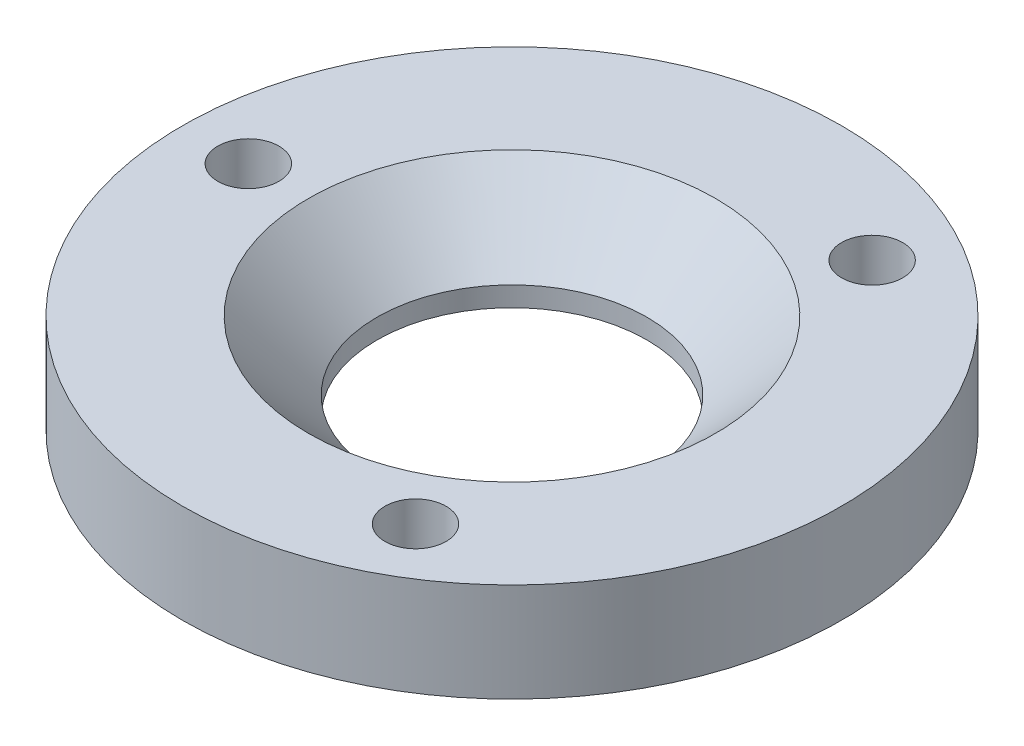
ISO-10303-21;
HEADER;
FILE_DESCRIPTION(('STEP AP214'),'2;1');
FILE_NAME('part.step','',(''),(''),'','','');
FILE_SCHEMA(('AUTOMOTIVE_DESIGN { 1 0 10303 214 1 1 1 1 }'));
ENDSEC;
DATA;
#1=APPLICATION_CONTEXT('core data for automotive mechanical design processes');
#2=APPLICATION_PROTOCOL_DEFINITION('international standard','automotive_design',2000,#1);
#3=PRODUCT_CONTEXT('',#1,'mechanical');
#4=PRODUCT('Part','Part','',(#3));
#5=PRODUCT_RELATED_PRODUCT_CATEGORY('part','',(#4));
#6=PRODUCT_DEFINITION_FORMATION('','',#4);
#7=PRODUCT_DEFINITION_CONTEXT('part definition',#1,'design');
#8=PRODUCT_DEFINITION('design','',#6,#7);
#9=PRODUCT_DEFINITION_SHAPE('','',#8);
#10=(LENGTH_UNIT() NAMED_UNIT(*) SI_UNIT(.MILLI.,.METRE.));
#11=(NAMED_UNIT(*) PLANE_ANGLE_UNIT() SI_UNIT($,.RADIAN.));
#12=(NAMED_UNIT(*) SI_UNIT($,.STERADIAN.) SOLID_ANGLE_UNIT());
#13=UNCERTAINTY_MEASURE_WITH_UNIT(LENGTH_MEASURE(1.E-05),#10,'distance_accuracy_value','');
#14=(GEOMETRIC_REPRESENTATION_CONTEXT(3) GLOBAL_UNCERTAINTY_ASSIGNED_CONTEXT((#13)) GLOBAL_UNIT_ASSIGNED_CONTEXT((#10,
#11,#12)) REPRESENTATION_CONTEXT('',''));
#15=CARTESIAN_POINT('',(0.,0.,0.));
#16=DIRECTION('',(0.,0.,1.));
#17=DIRECTION('',(1.,0.,0.));
#18=AXIS2_PLACEMENT_3D('',#15,#16,#17);
#19=CARTESIAN_POINT('',(0.,0.,0.));
#20=DIRECTION('',(0.,1.,0.));
#21=DIRECTION('',(0.,0.,1.));
#22=AXIS2_PLACEMENT_3D('',#19,#20,#21);
#23=CYLINDRICAL_SURFACE('',#22,10.16);
#24=CARTESIAN_POINT('',(0.,-4.7625,0.));
#25=DIRECTION('',(0.,1.,0.));
#26=DIRECTION('',(0.,0.,1.));
#27=AXIS2_PLACEMENT_3D('',#24,#25,#26);
#28=CIRCLE('',#27,10.16);
#29=CARTESIAN_POINT('',(0.,-4.7625,10.16));
#30=VERTEX_POINT('',#29);
#31=EDGE_CURVE('E42',#30,#30,#28,.T.);
#32=ORIENTED_EDGE('',*,*,#31,.F.);
#33=EDGE_LOOP('',(#32));
#34=FACE_BOUND('',#33,.T.);
#35=CARTESIAN_POINT('',(0.,-4.25450000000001,0.));
#36=DIRECTION('',(0.,1.,0.));
#37=DIRECTION('',(0.,0.,1.));
#38=AXIS2_PLACEMENT_3D('',#35,#36,#37);
#39=CIRCLE('',#38,10.16);
#40=CARTESIAN_POINT('',(0.,-4.25450000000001,10.16));
#41=VERTEX_POINT('',#40);
#42=EDGE_CURVE('E57',#41,#41,#39,.T.);
#43=ORIENTED_EDGE('',*,*,#42,.T.);
#44=EDGE_LOOP('',(#43));
#45=FACE_BOUND('',#44,.T.);
#46=ADVANCED_FACE('F32',(#34,#45),#23,.F.);
#47=CARTESIAN_POINT('',(0.,-4.7625,-15.875));
#48=DIRECTION('',(0.,1.,0.));
#49=DIRECTION('',(0.,0.,1.));
#50=AXIS2_PLACEMENT_3D('',#47,#48,#49);
#51=PLANE('',#50);
#52=CARTESIAN_POINT('',(6.3499999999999,-4.7625,-10.9985226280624));
#53=DIRECTION('',(0.,1.,0.));
#54=DIRECTION('',(0.,0.,1.));
#55=AXIS2_PLACEMENT_3D('',#52,#53,#54);
#56=CIRCLE('',#55,1.4732);
#57=CARTESIAN_POINT('',(6.3499999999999,-4.7625,-9.52532262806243));
#58=VERTEX_POINT('',#57);
#59=EDGE_CURVE('E75',#58,#58,#56,.T.);
#60=ORIENTED_EDGE('',*,*,#59,.T.);
#61=EDGE_LOOP('',(#60));
#62=FACE_BOUND('',#61,.T.);
#63=CARTESIAN_POINT('',(6.35000000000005,-4.7625,10.9985226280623));
#64=DIRECTION('',(0.,1.,0.));
#65=DIRECTION('',(0.,0.,1.));
#66=AXIS2_PLACEMENT_3D('',#63,#64,#65);
#67=CIRCLE('',#66,1.4732);
#68=CARTESIAN_POINT('',(6.35000000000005,-4.7625,12.4717226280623));
#69=VERTEX_POINT('',#68);
#70=EDGE_CURVE('E69',#69,#69,#67,.T.);
#71=ORIENTED_EDGE('',*,*,#70,.T.);
#72=EDGE_LOOP('',(#71));
#73=FACE_BOUND('',#72,.T.);
#74=CARTESIAN_POINT('',(-12.7,-4.7625,0.));
#75=DIRECTION('',(0.,1.,0.));
#76=DIRECTION('',(0.,0.,1.));
#77=AXIS2_PLACEMENT_3D('',#74,#75,#76);
#78=CIRCLE('',#77,1.4732);
#79=CARTESIAN_POINT('',(-12.7,-4.7625,1.4732));
#80=VERTEX_POINT('',#79);
#81=EDGE_CURVE('E63',#80,#80,#78,.T.);
#82=ORIENTED_EDGE('',*,*,#81,.T.);
#83=EDGE_LOOP('',(#82));
#84=FACE_BOUND('',#83,.T.);
#85=CARTESIAN_POINT('',(0.,-4.7625,0.));
#86=DIRECTION('',(0.,1.,0.));
#87=DIRECTION('',(0.,0.,1.));
#88=AXIS2_PLACEMENT_3D('',#85,#86,#87);
#89=CIRCLE('',#88,15.875);
#90=CARTESIAN_POINT('',(0.,-4.7625,15.875));
#91=VERTEX_POINT('',#90);
#92=EDGE_CURVE('E46',#91,#91,#89,.T.);
#93=ORIENTED_EDGE('',*,*,#92,.F.);
#94=EDGE_LOOP('',(#93));
#95=FACE_BOUND('',#94,.T.);
#96=ORIENTED_EDGE('',*,*,#31,.T.);
#97=EDGE_LOOP('',(#96));
#98=FACE_BOUND('',#97,.T.);
#99=ADVANCED_FACE('F79',(#62,#73,#84,#95,#98),#51,.F.);
#100=CARTESIAN_POINT('',(0.,0.,0.));
#101=DIRECTION('',(0.,1.,0.));
#102=DIRECTION('',(0.,0.,1.));
#103=AXIS2_PLACEMENT_3D('',#100,#101,#102);
#104=CYLINDRICAL_SURFACE('',#103,15.875);
#105=CARTESIAN_POINT('',(0.,0.,0.));
#106=DIRECTION('',(0.,1.,0.));
#107=DIRECTION('',(0.,0.,1.));
#108=AXIS2_PLACEMENT_3D('',#105,#106,#107);
#109=CIRCLE('',#108,15.875);
#110=CARTESIAN_POINT('',(0.,0.,15.875));
#111=VERTEX_POINT('',#110);
#112=EDGE_CURVE('E51',#111,#111,#109,.T.);
#113=ORIENTED_EDGE('',*,*,#112,.F.);
#114=EDGE_LOOP('',(#113));
#115=FACE_BOUND('',#114,.T.);
#116=ORIENTED_EDGE('',*,*,#92,.T.);
#117=EDGE_LOOP('',(#116));
#118=FACE_BOUND('',#117,.T.);
#119=ADVANCED_FACE('F94',(#115,#118),#104,.T.);
#120=CARTESIAN_POINT('',(0.,0.,-6.5024));
#121=DIRECTION('',(0.,-1.,0.));
#122=DIRECTION('',(0.,0.,-1.));
#123=AXIS2_PLACEMENT_3D('',#120,#121,#122);
#124=PLANE('',#123);
#125=CARTESIAN_POINT('',(0.,0.,0.));
#126=DIRECTION('',(0.,-1.,0.));
#127=DIRECTION('',(0.,0.,-1.));
#128=AXIS2_PLACEMENT_3D('',#125,#126,#127);
#129=CIRCLE('',#128,9.80440000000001);
#130=CARTESIAN_POINT('',(0.,0.,-9.80440000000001));
#131=VERTEX_POINT('',#130);
#132=EDGE_CURVE('E10',#131,#131,#129,.T.);
#133=ORIENTED_EDGE('',*,*,#132,.T.);
#134=EDGE_LOOP('',(#133));
#135=FACE_BOUND('',#134,.T.);
#136=CARTESIAN_POINT('',(6.3499999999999,0.,-10.9985226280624));
#137=DIRECTION('',(0.,1.,0.));
#138=DIRECTION('',(0.,0.,1.));
#139=AXIS2_PLACEMENT_3D('',#136,#137,#138);
#140=CIRCLE('',#139,1.4732);
#141=CARTESIAN_POINT('',(6.3499999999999,0.,-9.52532262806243));
#142=VERTEX_POINT('',#141);
#143=EDGE_CURVE('E72',#142,#142,#140,.T.);
#144=ORIENTED_EDGE('',*,*,#143,.F.);
#145=EDGE_LOOP('',(#144));
#146=FACE_BOUND('',#145,.T.);
#147=CARTESIAN_POINT('',(6.35000000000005,0.,10.9985226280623));
#148=DIRECTION('',(0.,1.,0.));
#149=DIRECTION('',(0.,0.,1.));
#150=AXIS2_PLACEMENT_3D('',#147,#148,#149);
#151=CIRCLE('',#150,1.4732);
#152=CARTESIAN_POINT('',(6.35000000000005,0.,12.4717226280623));
#153=VERTEX_POINT('',#152);
#154=EDGE_CURVE('E66',#153,#153,#151,.T.);
#155=ORIENTED_EDGE('',*,*,#154,.F.);
#156=EDGE_LOOP('',(#155));
#157=FACE_BOUND('',#156,.T.);
#158=CARTESIAN_POINT('',(-12.7,0.,0.));
#159=DIRECTION('',(0.,1.,0.));
#160=DIRECTION('',(0.,0.,1.));
#161=AXIS2_PLACEMENT_3D('',#158,#159,#160);
#162=CIRCLE('',#161,1.4732);
#163=CARTESIAN_POINT('',(-12.7,0.,1.4732));
#164=VERTEX_POINT('',#163);
#165=EDGE_CURVE('E60',#164,#164,#162,.T.);
#166=ORIENTED_EDGE('',*,*,#165,.F.);
#167=EDGE_LOOP('',(#166));
#168=FACE_BOUND('',#167,.T.);
#169=ORIENTED_EDGE('',*,*,#112,.T.);
#170=EDGE_LOOP('',(#169));
#171=FACE_BOUND('',#170,.T.);
#172=ADVANCED_FACE('F90',(#135,#146,#157,#168,#171),#124,.F.);
#173=CARTESIAN_POINT('',(0.,0.,0.));
#174=DIRECTION('',(0.,1.,0.));
#175=DIRECTION('',(0.,0.,1.));
#176=AXIS2_PLACEMENT_3D('',#173,#174,#175);
#177=CYLINDRICAL_SURFACE('',#176,6.5024);
#178=CARTESIAN_POINT('',(0.,-3.302,0.));
#179=DIRECTION('',(0.,-1.,0.));
#180=DIRECTION('',(0.,0.,-1.));
#181=AXIS2_PLACEMENT_3D('',#178,#179,#180);
#182=CIRCLE('',#181,6.5024);
#183=CARTESIAN_POINT('',(0.,-3.302,-6.5024));
#184=VERTEX_POINT('',#183);
#185=EDGE_CURVE('E38',#184,#184,#182,.F.);
#186=ORIENTED_EDGE('',*,*,#185,.T.);
#187=EDGE_LOOP('',(#186));
#188=FACE_BOUND('',#187,.T.);
#189=CARTESIAN_POINT('',(0.,-4.25450000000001,0.));
#190=DIRECTION('',(0.,1.,0.));
#191=DIRECTION('',(0.,0.,1.));
#192=AXIS2_PLACEMENT_3D('',#189,#190,#191);
#193=CIRCLE('',#192,6.5024);
#194=CARTESIAN_POINT('',(0.,-4.25450000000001,6.5024));
#195=VERTEX_POINT('',#194);
#196=EDGE_CURVE('E54',#195,#195,#193,.T.);
#197=ORIENTED_EDGE('',*,*,#196,.F.);
#198=EDGE_LOOP('',(#197));
#199=FACE_BOUND('',#198,.T.);
#200=ADVANCED_FACE('F93',(#188,#199),#177,.F.);
#201=CARTESIAN_POINT('',(0.,-4.25450000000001,-6.5024));
#202=DIRECTION('',(0.,1.,0.));
#203=DIRECTION('',(0.,0.,1.));
#204=AXIS2_PLACEMENT_3D('',#201,#202,#203);
#205=PLANE('',#204);
#206=ORIENTED_EDGE('',*,*,#42,.F.);
#207=EDGE_LOOP('',(#206));
#208=FACE_BOUND('',#207,.T.);
#209=ORIENTED_EDGE('',*,*,#196,.T.);
#210=EDGE_LOOP('',(#209));
#211=FACE_BOUND('',#210,.T.);
#212=ADVANCED_FACE('F115',(#208,#211),#205,.F.);
#213=CARTESIAN_POINT('',(-12.7,0.,0.));
#214=DIRECTION('',(0.,1.,0.));
#215=DIRECTION('',(0.,0.,1.));
#216=AXIS2_PLACEMENT_3D('',#213,#214,#215);
#217=CYLINDRICAL_SURFACE('',#216,1.4732);
#218=ORIENTED_EDGE('',*,*,#81,.F.);
#219=EDGE_LOOP('',(#218));
#220=FACE_BOUND('',#219,.T.);
#221=ORIENTED_EDGE('',*,*,#165,.T.);
#222=EDGE_LOOP('',(#221));
#223=FACE_BOUND('',#222,.T.);
#224=ADVANCED_FACE('F118',(#220,#223),#217,.F.);
#225=CARTESIAN_POINT('',(6.35000000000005,0.,10.9985226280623));
#226=DIRECTION('',(0.,1.,0.));
#227=DIRECTION('',(0.,0.,1.));
#228=AXIS2_PLACEMENT_3D('',#225,#226,#227);
#229=CYLINDRICAL_SURFACE('',#228,1.4732);
#230=ORIENTED_EDGE('',*,*,#70,.F.);
#231=EDGE_LOOP('',(#230));
#232=FACE_BOUND('',#231,.T.);
#233=ORIENTED_EDGE('',*,*,#154,.T.);
#234=EDGE_LOOP('',(#233));
#235=FACE_BOUND('',#234,.T.);
#236=ADVANCED_FACE('F86',(#232,#235),#229,.F.);
#237=CARTESIAN_POINT('',(6.3499999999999,0.,-10.9985226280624));
#238=DIRECTION('',(0.,1.,0.));
#239=DIRECTION('',(0.,0.,1.));
#240=AXIS2_PLACEMENT_3D('',#237,#238,#239);
#241=CYLINDRICAL_SURFACE('',#240,1.4732);
#242=ORIENTED_EDGE('',*,*,#59,.F.);
#243=EDGE_LOOP('',(#242));
#244=FACE_BOUND('',#243,.T.);
#245=ORIENTED_EDGE('',*,*,#143,.T.);
#246=EDGE_LOOP('',(#245));
#247=FACE_BOUND('',#246,.T.);
#248=ADVANCED_FACE('F82',(#244,#247),#241,.F.);
#249=CARTESIAN_POINT('',(0.,-3.302,0.));
#250=DIRECTION('',(0.,1.,0.));
#251=DIRECTION('',(0.,0.,1.));
#252=AXIS2_PLACEMENT_3D('',#249,#250,#251);
#253=CONICAL_SURFACE('',#252,6.5024,0.78539816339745);
#254=ORIENTED_EDGE('',*,*,#132,.F.);
#255=EDGE_LOOP('',(#254));
#256=FACE_BOUND('',#255,.T.);
#257=ORIENTED_EDGE('',*,*,#185,.F.);
#258=EDGE_LOOP('',(#257));
#259=FACE_BOUND('',#258,.T.);
#260=ADVANCED_FACE('F85',(#256,#259),#253,.F.);
#261=CLOSED_SHELL('',(#46,#99,#119,#172,#200,#212,#224,#236,#248,#260));
#262=MANIFOLD_SOLID_BREP('B2',#261);
#263=ADVANCED_BREP_SHAPE_REPRESENTATION('',(#18,#262),#14);
#264=SHAPE_DEFINITION_REPRESENTATION(#9,#263);
ENDSEC;
END-ISO-10303-21;
